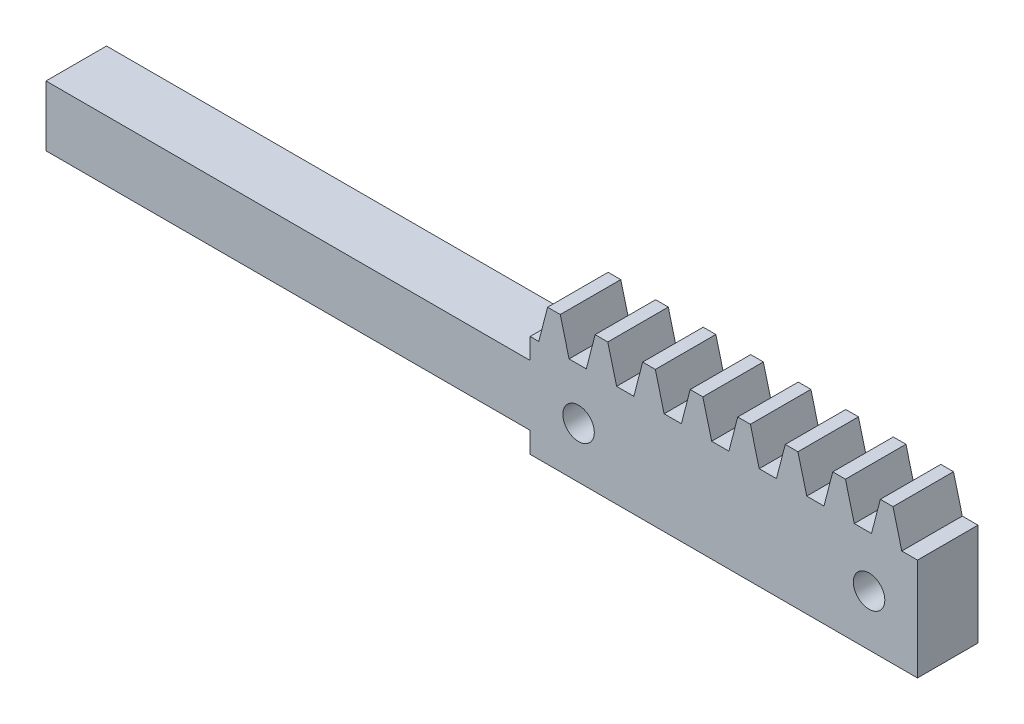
ISO-10303-21;
HEADER;
FILE_DESCRIPTION(('STEP AP214'),'2;1');
FILE_NAME('part.step','',(''),(''),'','','');
FILE_SCHEMA(('AUTOMOTIVE_DESIGN { 1 0 10303 214 1 1 1 1 }'));
ENDSEC;
DATA;
#1=APPLICATION_CONTEXT('core data for automotive mechanical design processes');
#2=APPLICATION_PROTOCOL_DEFINITION('international standard','automotive_design',2000,#1);
#3=PRODUCT_CONTEXT('',#1,'mechanical');
#4=PRODUCT('Part','Part','',(#3));
#5=PRODUCT_RELATED_PRODUCT_CATEGORY('part','',(#4));
#6=PRODUCT_DEFINITION_FORMATION('','',#4);
#7=PRODUCT_DEFINITION_CONTEXT('part definition',#1,'design');
#8=PRODUCT_DEFINITION('design','',#6,#7);
#9=PRODUCT_DEFINITION_SHAPE('','',#8);
#10=(LENGTH_UNIT() NAMED_UNIT(*) SI_UNIT(.MILLI.,.METRE.));
#11=(NAMED_UNIT(*) PLANE_ANGLE_UNIT() SI_UNIT($,.RADIAN.));
#12=(NAMED_UNIT(*) SI_UNIT($,.STERADIAN.) SOLID_ANGLE_UNIT());
#13=UNCERTAINTY_MEASURE_WITH_UNIT(LENGTH_MEASURE(1.E-05),#10,'distance_accuracy_value','');
#14=(GEOMETRIC_REPRESENTATION_CONTEXT(3) GLOBAL_UNCERTAINTY_ASSIGNED_CONTEXT((#13)) GLOBAL_UNIT_ASSIGNED_CONTEXT((#10,
#11,#12)) REPRESENTATION_CONTEXT('',''));
#15=CARTESIAN_POINT('',(0.,0.,0.));
#16=DIRECTION('',(0.,0.,1.));
#17=DIRECTION('',(1.,0.,0.));
#18=AXIS2_PLACEMENT_3D('',#15,#16,#17);
#19=CARTESIAN_POINT('',(0.988416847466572,2.95474098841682,-4.7625));
#20=DIRECTION('',(-1.,0.,0.));
#21=DIRECTION('',(0.,0.,1.));
#22=AXIS2_PLACEMENT_3D('',#19,#20,#21);
#23=PLANE('',#22);
#24=DIRECTION('',(0.,-1.,0.));
#25=VECTOR('',#24,1.);
#26=CARTESIAN_POINT('',(0.988416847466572,2.95474098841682,-4.7625));
#27=LINE('',#26,#25);
#28=CARTESIAN_POINT('',(0.988416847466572,8.31255348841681,-4.7625));
#29=VERTEX_POINT('',#28);
#30=CARTESIAN_POINT('',(0.988416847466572,7.22114723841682,-4.7625));
#31=VERTEX_POINT('',#30);
#32=EDGE_CURVE('E309',#29,#31,#27,.T.);
#33=ORIENTED_EDGE('',*,*,#32,.T.);
#34=DIRECTION('',(0.,0.,1.));
#35=VECTOR('',#34,1.);
#36=CARTESIAN_POINT('',(0.988416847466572,7.22114723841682,-4.7625));
#37=LINE('',#36,#35);
#38=CARTESIAN_POINT('',(0.988416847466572,7.22114723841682,-1.5875));
#39=VERTEX_POINT('',#38);
#40=EDGE_CURVE('E292',#31,#39,#37,.T.);
#41=ORIENTED_EDGE('',*,*,#40,.T.);
#42=DIRECTION('',(0.,-1.,0.));
#43=VECTOR('',#42,1.);
#44=CARTESIAN_POINT('',(0.988416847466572,2.95474098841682,-1.5875));
#45=LINE('',#44,#43);
#46=CARTESIAN_POINT('',(0.988416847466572,8.31255348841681,-1.5875));
#47=VERTEX_POINT('',#46);
#48=EDGE_CURVE('E349',#47,#39,#45,.T.);
#49=ORIENTED_EDGE('',*,*,#48,.F.);
#50=DIRECTION('',(0.,0.,1.));
#51=VECTOR('',#50,1.);
#52=CARTESIAN_POINT('',(0.988416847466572,8.31255348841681,-4.7625));
#53=LINE('',#52,#51);
#54=EDGE_CURVE('E316',#29,#47,#53,.T.);
#55=ORIENTED_EDGE('',*,*,#54,.F.);
#56=EDGE_LOOP('',(#33,#41,#49,#55));
#57=FACE_BOUND('',#56,.T.);
#58=ADVANCED_FACE('F35',(#57),#23,.T.);
#59=CARTESIAN_POINT('',(0.988416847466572,10.0984909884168,-4.7625));
#60=DIRECTION('',(0.,1.,0.));
#61=DIRECTION('',(0.,0.,1.));
#62=AXIS2_PLACEMENT_3D('',#59,#60,#61);
#63=PLANE('',#62);
#64=DIRECTION('',(0.,0.,1.));
#65=VECTOR('',#64,1.);
#66=CARTESIAN_POINT('',(17.5294785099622,10.0984909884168,-4.7625));
#67=LINE('',#66,#65);
#68=CARTESIAN_POINT('',(17.5294785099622,10.0984909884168,-4.7625));
#69=VERTEX_POINT('',#68);
#70=CARTESIAN_POINT('',(17.5294785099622,10.0984909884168,-1.5875));
#71=VERTEX_POINT('',#70);
#72=EDGE_CURVE('E511',#69,#71,#67,.T.);
#73=ORIENTED_EDGE('',*,*,#72,.F.);
#74=DIRECTION('',(-1.,0.,0.));
#75=VECTOR('',#74,1.);
#76=CARTESIAN_POINT('',(0.988416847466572,10.0984909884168,-4.7625));
#77=LINE('',#76,#75);
#78=CARTESIAN_POINT('',(16.8646643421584,10.0984909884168,-4.7625));
#79=VERTEX_POINT('',#78);
#80=EDGE_CURVE('E340',#69,#79,#77,.T.);
#81=ORIENTED_EDGE('',*,*,#80,.T.);
#82=DIRECTION('',(0.,0.,-1.));
#83=VECTOR('',#82,1.);
#84=CARTESIAN_POINT('',(16.8646643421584,10.0984909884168,-4.7625));
#85=LINE('',#84,#83);
#86=CARTESIAN_POINT('',(16.8646643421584,10.0984909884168,-1.5875));
#87=VERTEX_POINT('',#86);
#88=EDGE_CURVE('E496',#87,#79,#85,.T.);
#89=ORIENTED_EDGE('',*,*,#88,.F.);
#90=DIRECTION('',(-1.,0.,0.));
#91=VECTOR('',#90,1.);
#92=CARTESIAN_POINT('',(0.988416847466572,10.0984909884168,-1.5875));
#93=LINE('',#92,#91);
#94=EDGE_CURVE('E664',#71,#87,#93,.T.);
#95=ORIENTED_EDGE('',*,*,#94,.F.);
#96=EDGE_LOOP('',(#73,#81,#89,#95));
#97=FACE_BOUND('',#96,.T.);
#98=ADVANCED_FACE('F608',(#97),#63,.T.);
#99=DIRECTION('',(0.,0.,1.));
#100=VECTOR('',#99,1.);
#101=CARTESIAN_POINT('',(15.0358393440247,10.0984909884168,-4.7625));
#102=LINE('',#101,#100);
#103=CARTESIAN_POINT('',(15.0358393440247,10.0984909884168,-4.7625));
#104=VERTEX_POINT('',#103);
#105=CARTESIAN_POINT('',(15.0358393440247,10.0984909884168,-1.5875));
#106=VERTEX_POINT('',#105);
#107=EDGE_CURVE('E487',#104,#106,#102,.T.);
#108=ORIENTED_EDGE('',*,*,#107,.F.);
#109=CARTESIAN_POINT('',(14.3710251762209,10.0984909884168,-4.7625));
#110=VERTEX_POINT('',#109);
#111=EDGE_CURVE('E698',#104,#110,#77,.T.);
#112=ORIENTED_EDGE('',*,*,#111,.T.);
#113=DIRECTION('',(0.,0.,-1.));
#114=VECTOR('',#113,1.);
#115=CARTESIAN_POINT('',(14.3710251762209,10.0984909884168,-4.7625));
#116=LINE('',#115,#114);
#117=CARTESIAN_POINT('',(14.3710251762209,10.0984909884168,-1.5875));
#118=VERTEX_POINT('',#117);
#119=EDGE_CURVE('E472',#118,#110,#116,.T.);
#120=ORIENTED_EDGE('',*,*,#119,.F.);
#121=EDGE_CURVE('E670',#106,#118,#93,.T.);
#122=ORIENTED_EDGE('',*,*,#121,.F.);
#123=EDGE_LOOP('',(#108,#112,#120,#122));
#124=FACE_BOUND('',#123,.T.);
#125=ADVANCED_FACE('F612',(#124),#63,.T.);
#126=DIRECTION('',(0.,0.,1.));
#127=VECTOR('',#126,1.);
#128=CARTESIAN_POINT('',(12.5422001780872,10.0984909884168,-4.7625));
#129=LINE('',#128,#127);
#130=CARTESIAN_POINT('',(12.5422001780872,10.0984909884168,-4.7625));
#131=VERTEX_POINT('',#130);
#132=CARTESIAN_POINT('',(12.5422001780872,10.0984909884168,-1.5875));
#133=VERTEX_POINT('',#132);
#134=EDGE_CURVE('E463',#131,#133,#129,.T.);
#135=ORIENTED_EDGE('',*,*,#134,.F.);
#136=CARTESIAN_POINT('',(11.8773860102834,10.0984909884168,-4.7625));
#137=VERTEX_POINT('',#136);
#138=EDGE_CURVE('E697',#131,#137,#77,.T.);
#139=ORIENTED_EDGE('',*,*,#138,.T.);
#140=DIRECTION('',(0.,0.,-1.));
#141=VECTOR('',#140,1.);
#142=CARTESIAN_POINT('',(11.8773860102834,10.0984909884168,-4.7625));
#143=LINE('',#142,#141);
#144=CARTESIAN_POINT('',(11.8773860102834,10.0984909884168,-1.5875));
#145=VERTEX_POINT('',#144);
#146=EDGE_CURVE('E448',#145,#137,#143,.T.);
#147=ORIENTED_EDGE('',*,*,#146,.F.);
#148=EDGE_CURVE('E672',#133,#145,#93,.T.);
#149=ORIENTED_EDGE('',*,*,#148,.F.);
#150=EDGE_LOOP('',(#135,#139,#147,#149));
#151=FACE_BOUND('',#150,.T.);
#152=ADVANCED_FACE('F695',(#151),#63,.T.);
#153=DIRECTION('',(0.,0.,1.));
#154=VECTOR('',#153,1.);
#155=CARTESIAN_POINT('',(10.0485610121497,10.0984909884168,-4.7625));
#156=LINE('',#155,#154);
#157=CARTESIAN_POINT('',(10.0485610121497,10.0984909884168,-4.7625));
#158=VERTEX_POINT('',#157);
#159=CARTESIAN_POINT('',(10.0485610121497,10.0984909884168,-1.5875));
#160=VERTEX_POINT('',#159);
#161=EDGE_CURVE('E439',#158,#160,#156,.T.);
#162=ORIENTED_EDGE('',*,*,#161,.F.);
#163=CARTESIAN_POINT('',(9.38374684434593,10.0984909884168,-4.7625));
#164=VERTEX_POINT('',#163);
#165=EDGE_CURVE('E699',#158,#164,#77,.T.);
#166=ORIENTED_EDGE('',*,*,#165,.T.);
#167=DIRECTION('',(0.,0.,-1.));
#168=VECTOR('',#167,1.);
#169=CARTESIAN_POINT('',(9.38374684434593,10.0984909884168,-4.7625));
#170=LINE('',#169,#168);
#171=CARTESIAN_POINT('',(9.38374684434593,10.0984909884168,-1.5875));
#172=VERTEX_POINT('',#171);
#173=EDGE_CURVE('E424',#172,#164,#170,.T.);
#174=ORIENTED_EDGE('',*,*,#173,.F.);
#175=EDGE_CURVE('E679',#160,#172,#93,.T.);
#176=ORIENTED_EDGE('',*,*,#175,.F.);
#177=EDGE_LOOP('',(#162,#166,#174,#176));
#178=FACE_BOUND('',#177,.T.);
#179=ADVANCED_FACE('F1009',(#178),#63,.T.);
#180=DIRECTION('',(0.,0.,1.));
#181=VECTOR('',#180,1.);
#182=CARTESIAN_POINT('',(7.55492184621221,10.0984909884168,-4.7625));
#183=LINE('',#182,#181);
#184=CARTESIAN_POINT('',(7.55492184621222,10.0984909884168,-4.7625));
#185=VERTEX_POINT('',#184);
#186=CARTESIAN_POINT('',(7.55492184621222,10.0984909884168,-1.5875));
#187=VERTEX_POINT('',#186);
#188=EDGE_CURVE('E415',#185,#187,#183,.T.);
#189=ORIENTED_EDGE('',*,*,#188,.F.);
#190=CARTESIAN_POINT('',(6.89010767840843,10.0984909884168,-4.7625));
#191=VERTEX_POINT('',#190);
#192=EDGE_CURVE('E700',#185,#191,#77,.T.);
#193=ORIENTED_EDGE('',*,*,#192,.T.);
#194=DIRECTION('',(0.,0.,-1.));
#195=VECTOR('',#194,1.);
#196=CARTESIAN_POINT('',(6.89010767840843,10.0984909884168,-4.7625));
#197=LINE('',#196,#195);
#198=CARTESIAN_POINT('',(6.89010767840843,10.0984909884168,-1.5875));
#199=VERTEX_POINT('',#198);
#200=EDGE_CURVE('E400',#199,#191,#197,.T.);
#201=ORIENTED_EDGE('',*,*,#200,.F.);
#202=EDGE_CURVE('E676',#187,#199,#93,.T.);
#203=ORIENTED_EDGE('',*,*,#202,.F.);
#204=EDGE_LOOP('',(#189,#193,#201,#203));
#205=FACE_BOUND('',#204,.T.);
#206=ADVANCED_FACE('F1016',(#205),#63,.T.);
#207=DIRECTION('',(0.,0.,1.));
#208=VECTOR('',#207,1.);
#209=CARTESIAN_POINT('',(5.06128268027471,10.0984909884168,-4.7625));
#210=LINE('',#209,#208);
#211=CARTESIAN_POINT('',(5.06128268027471,10.0984909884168,-4.7625));
#212=VERTEX_POINT('',#211);
#213=CARTESIAN_POINT('',(5.06128268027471,10.0984909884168,-1.5875));
#214=VERTEX_POINT('',#213);
#215=EDGE_CURVE('E391',#212,#214,#210,.T.);
#216=ORIENTED_EDGE('',*,*,#215,.F.);
#217=CARTESIAN_POINT('',(4.39646851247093,10.0984909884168,-4.7625));
#218=VERTEX_POINT('',#217);
#219=EDGE_CURVE('E705',#212,#218,#77,.T.);
#220=ORIENTED_EDGE('',*,*,#219,.T.);
#221=DIRECTION('',(0.,0.,-1.));
#222=VECTOR('',#221,1.);
#223=CARTESIAN_POINT('',(4.39646851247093,10.0984909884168,-4.7625));
#224=LINE('',#223,#222);
#225=CARTESIAN_POINT('',(4.39646851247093,10.0984909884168,-1.5875));
#226=VERTEX_POINT('',#225);
#227=EDGE_CURVE('E376',#226,#218,#224,.T.);
#228=ORIENTED_EDGE('',*,*,#227,.F.);
#229=EDGE_CURVE('E673',#214,#226,#93,.T.);
#230=ORIENTED_EDGE('',*,*,#229,.F.);
#231=EDGE_LOOP('',(#216,#220,#228,#230));
#232=FACE_BOUND('',#231,.T.);
#233=ADVANCED_FACE('F624',(#232),#63,.T.);
#234=DIRECTION('',(0.,0.,1.));
#235=VECTOR('',#234,1.);
#236=CARTESIAN_POINT('',(2.56764351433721,10.0984909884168,-4.7625));
#237=LINE('',#236,#235);
#238=CARTESIAN_POINT('',(2.56764351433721,10.0984909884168,-4.7625));
#239=VERTEX_POINT('',#238);
#240=CARTESIAN_POINT('',(2.56764351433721,10.0984909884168,-1.5875));
#241=VERTEX_POINT('',#240);
#242=EDGE_CURVE('E372',#239,#241,#237,.T.);
#243=ORIENTED_EDGE('',*,*,#242,.F.);
#244=CARTESIAN_POINT('',(1.90282934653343,10.0984909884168,-4.7625));
#245=VERTEX_POINT('',#244);
#246=EDGE_CURVE('E336',#239,#245,#77,.T.);
#247=ORIENTED_EDGE('',*,*,#246,.T.);
#248=DIRECTION('',(0.,0.,-1.));
#249=VECTOR('',#248,1.);
#250=CARTESIAN_POINT('',(1.90282934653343,10.0984909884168,-4.7625));
#251=LINE('',#250,#249);
#252=CARTESIAN_POINT('',(1.90282934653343,10.0984909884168,-1.5875));
#253=VERTEX_POINT('',#252);
#254=EDGE_CURVE('E330',#253,#245,#251,.T.);
#255=ORIENTED_EDGE('',*,*,#254,.F.);
#256=EDGE_CURVE('E671',#241,#253,#93,.T.);
#257=ORIENTED_EDGE('',*,*,#256,.F.);
#258=EDGE_LOOP('',(#243,#247,#255,#257));
#259=FACE_BOUND('',#258,.T.);
#260=ADVANCED_FACE('F616',(#259),#63,.T.);
#261=DIRECTION('',(0.,0.,1.));
#262=VECTOR('',#261,1.);
#263=CARTESIAN_POINT('',(0.988416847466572,4.04614723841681,-4.7625));
#264=LINE('',#263,#262);
#265=CARTESIAN_POINT('',(0.988416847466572,4.04614723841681,-4.7625));
#266=VERTEX_POINT('',#265);
#267=CARTESIAN_POINT('',(0.988416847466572,4.04614723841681,-1.5875));
#268=VERTEX_POINT('',#267);
#269=EDGE_CURVE('E566',#266,#268,#264,.T.);
#270=ORIENTED_EDGE('',*,*,#269,.F.);
#271=CARTESIAN_POINT('',(0.988416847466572,2.95474098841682,-4.7625));
#272=VERTEX_POINT('',#271);
#273=EDGE_CURVE('E318',#266,#272,#27,.T.);
#274=ORIENTED_EDGE('',*,*,#273,.T.);
#275=DIRECTION('',(0.,0.,1.));
#276=VECTOR('',#275,1.);
#277=CARTESIAN_POINT('',(0.988416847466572,2.95474098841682,-4.7625));
#278=LINE('',#277,#276);
#279=CARTESIAN_POINT('',(0.988416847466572,2.95474098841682,-1.5875));
#280=VERTEX_POINT('',#279);
#281=EDGE_CURVE('E339',#272,#280,#278,.T.);
#282=ORIENTED_EDGE('',*,*,#281,.T.);
#283=EDGE_CURVE('E347',#268,#280,#45,.T.);
#284=ORIENTED_EDGE('',*,*,#283,.F.);
#285=EDGE_LOOP('',(#270,#274,#282,#284));
#286=FACE_BOUND('',#285,.T.);
#287=ADVANCED_FACE('F37',(#286),#23,.T.);
#288=DIRECTION('',(0.,0.,1.));
#289=VECTOR('',#288,1.);
#290=CARTESIAN_POINT('',(20.0231176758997,10.0984909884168,-4.7625));
#291=LINE('',#290,#289);
#292=CARTESIAN_POINT('',(20.0231176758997,10.0984909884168,-4.7625));
#293=VERTEX_POINT('',#292);
#294=CARTESIAN_POINT('',(20.0231176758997,10.0984909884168,-1.5875));
#295=VERTEX_POINT('',#294);
#296=EDGE_CURVE('E535',#293,#295,#291,.T.);
#297=ORIENTED_EDGE('',*,*,#296,.F.);
#298=CARTESIAN_POINT('',(19.3583035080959,10.0984909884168,-4.7625));
#299=VERTEX_POINT('',#298);
#300=EDGE_CURVE('E337',#293,#299,#77,.T.);
#301=ORIENTED_EDGE('',*,*,#300,.T.);
#302=DIRECTION('',(0.,0.,-1.));
#303=VECTOR('',#302,1.);
#304=CARTESIAN_POINT('',(19.3583035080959,10.0984909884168,-4.7625));
#305=LINE('',#304,#303);
#306=CARTESIAN_POINT('',(19.3583035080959,10.0984909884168,-1.5875));
#307=VERTEX_POINT('',#306);
#308=EDGE_CURVE('E520',#307,#299,#305,.T.);
#309=ORIENTED_EDGE('',*,*,#308,.F.);
#310=EDGE_CURVE('E323',#295,#307,#93,.T.);
#311=ORIENTED_EDGE('',*,*,#310,.F.);
#312=EDGE_LOOP('',(#297,#301,#309,#311));
#313=FACE_BOUND('',#312,.T.);
#314=ADVANCED_FACE('F614',(#313),#63,.T.);
#315=CARTESIAN_POINT('',(21.3084168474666,2.95474098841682,-4.7625));
#316=DIRECTION('',(1.,0.,0.));
#317=DIRECTION('',(0.,0.,-1.));
#318=AXIS2_PLACEMENT_3D('',#315,#316,#317);
#319=PLANE('',#318);
#320=DIRECTION('',(0.,0.,-1.));
#321=VECTOR('',#320,1.);
#322=CARTESIAN_POINT('',(21.3084168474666,8.31255348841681,-4.7625));
#323=LINE('',#322,#321);
#324=CARTESIAN_POINT('',(21.3084168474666,8.31255348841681,-1.5875));
#325=VERTEX_POINT('',#324);
#326=CARTESIAN_POINT('',(21.3084168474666,8.31255348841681,-4.7625));
#327=VERTEX_POINT('',#326);
#328=EDGE_CURVE('E544',#325,#327,#323,.T.);
#329=ORIENTED_EDGE('',*,*,#328,.F.);
#330=DIRECTION('',(0.,1.,0.));
#331=VECTOR('',#330,1.);
#332=CARTESIAN_POINT('',(21.3084168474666,2.95474098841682,-1.5875));
#333=LINE('',#332,#331);
#334=CARTESIAN_POINT('',(21.3084168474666,2.95474098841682,-1.5875));
#335=VERTEX_POINT('',#334);
#336=EDGE_CURVE('E353',#335,#325,#333,.T.);
#337=ORIENTED_EDGE('',*,*,#336,.F.);
#338=DIRECTION('',(0.,0.,1.));
#339=VECTOR('',#338,1.);
#340=CARTESIAN_POINT('',(21.3084168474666,2.95474098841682,-4.7625));
#341=LINE('',#340,#339);
#342=CARTESIAN_POINT('',(21.3084168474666,2.95474098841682,-4.7625));
#343=VERTEX_POINT('',#342);
#344=EDGE_CURVE('E634',#343,#335,#341,.T.);
#345=ORIENTED_EDGE('',*,*,#344,.F.);
#346=DIRECTION('',(0.,1.,0.));
#347=VECTOR('',#346,1.);
#348=CARTESIAN_POINT('',(21.3084168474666,2.95474098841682,-4.7625));
#349=LINE('',#348,#347);
#350=EDGE_CURVE('E321',#343,#327,#349,.T.);
#351=ORIENTED_EDGE('',*,*,#350,.T.);
#352=EDGE_LOOP('',(#329,#337,#345,#351));
#353=FACE_BOUND('',#352,.T.);
#354=ADVANCED_FACE('F622',(#353),#319,.T.);
#355=CARTESIAN_POINT('',(0.988416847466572,2.95474098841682,-4.7625));
#356=DIRECTION('',(0.,-1.,0.));
#357=DIRECTION('',(0.,0.,-1.));
#358=AXIS2_PLACEMENT_3D('',#355,#356,#357);
#359=PLANE('',#358);
#360=DIRECTION('',(1.,0.,0.));
#361=VECTOR('',#360,1.);
#362=CARTESIAN_POINT('',(0.988416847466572,2.95474098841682,-1.5875));
#363=LINE('',#362,#361);
#364=EDGE_CURVE('E343',#280,#335,#363,.T.);
#365=ORIENTED_EDGE('',*,*,#364,.F.);
#366=ORIENTED_EDGE('',*,*,#281,.F.);
#367=DIRECTION('',(1.,0.,0.));
#368=VECTOR('',#367,1.);
#369=CARTESIAN_POINT('',(0.988416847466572,2.95474098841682,-4.7625));
#370=LINE('',#369,#368);
#371=EDGE_CURVE('E317',#272,#343,#370,.T.);
#372=ORIENTED_EDGE('',*,*,#371,.T.);
#373=ORIENTED_EDGE('',*,*,#344,.T.);
#374=EDGE_LOOP('',(#365,#366,#372,#373));
#375=FACE_BOUND('',#374,.T.);
#376=ADVANCED_FACE('F601',(#375),#359,.T.);
#377=CARTESIAN_POINT('',(0.988416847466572,10.0984909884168,-4.7625));
#378=DIRECTION('',(0.,0.,-1.));
#379=DIRECTION('',(-1.,0.,0.));
#380=AXIS2_PLACEMENT_3D('',#377,#378,#379);
#381=PLANE('',#380);
#382=CARTESIAN_POINT('',(18.7684168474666,5.63364723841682,-4.7625));
#383=DIRECTION('',(0.,0.,-1.));
#384=DIRECTION('',(-1.,0.,0.));
#385=AXIS2_PLACEMENT_3D('',#382,#383,#384);
#386=CIRCLE('',#385,0.8255);
#387=CARTESIAN_POINT('',(17.9429168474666,5.63364723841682,-4.7625));
#388=VERTEX_POINT('',#387);
#389=EDGE_CURVE('E560',#388,#388,#386,.T.);
#390=ORIENTED_EDGE('',*,*,#389,.F.);
#391=EDGE_LOOP('',(#390));
#392=FACE_BOUND('',#391,.T.);
#393=CARTESIAN_POINT('',(3.52841684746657,5.63364723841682,-4.7625));
#394=DIRECTION('',(0.,0.,-1.));
#395=DIRECTION('',(-1.,0.,0.));
#396=AXIS2_PLACEMENT_3D('',#393,#394,#395);
#397=CIRCLE('',#396,0.8255);
#398=CARTESIAN_POINT('',(2.70291684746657,5.63364723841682,-4.7625));
#399=VERTEX_POINT('',#398);
#400=EDGE_CURVE('E551',#399,#399,#397,.T.);
#401=ORIENTED_EDGE('',*,*,#400,.F.);
#402=EDGE_LOOP('',(#401));
#403=FACE_BOUND('',#402,.T.);
#404=DIRECTION('',(0.250380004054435,-0.968147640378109,0.));
#405=VECTOR('',#404,1.);
#406=CARTESIAN_POINT('',(20.0198332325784,10.1111909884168,-4.7625));
#407=LINE('',#406,#405);
#408=CARTESIAN_POINT('',(20.4849925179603,8.31255348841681,-4.7625));
#409=VERTEX_POINT('',#408);
#410=EDGE_CURVE('E550',#293,#409,#407,.T.);
#411=ORIENTED_EDGE('',*,*,#410,.T.);
#412=DIRECTION('',(1.,0.,0.));
#413=VECTOR('',#412,1.);
#414=CARTESIAN_POINT('',(21.3900678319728,8.31255348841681,-4.7625));
#415=LINE('',#414,#413);
#416=EDGE_CURVE('E547',#409,#327,#415,.T.);
#417=ORIENTED_EDGE('',*,*,#416,.T.);
#418=ORIENTED_EDGE('',*,*,#350,.F.);
#419=ORIENTED_EDGE('',*,*,#371,.F.);
#420=ORIENTED_EDGE('',*,*,#273,.F.);
#421=DIRECTION('',(1.,0.,0.));
#422=VECTOR('',#421,1.);
#423=CARTESIAN_POINT('',(-24.4115831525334,4.04614723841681,-4.7625));
#424=LINE('',#423,#422);
#425=CARTESIAN_POINT('',(-24.4115831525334,4.04614723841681,-4.7625));
#426=VERTEX_POINT('',#425);
#427=EDGE_CURVE('E301',#426,#266,#424,.T.);
#428=ORIENTED_EDGE('',*,*,#427,.F.);
#429=DIRECTION('',(0.,-1.,0.));
#430=VECTOR('',#429,1.);
#431=CARTESIAN_POINT('',(-24.4115831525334,7.22114723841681,-4.7625));
#432=LINE('',#431,#430);
#433=CARTESIAN_POINT('',(-24.4115831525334,7.22114723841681,-4.7625));
#434=VERTEX_POINT('',#433);
#435=EDGE_CURVE('E312',#434,#426,#432,.T.);
#436=ORIENTED_EDGE('',*,*,#435,.F.);
#437=DIRECTION('',(-1.,0.,0.));
#438=VECTOR('',#437,1.);
#439=CARTESIAN_POINT('',(0.988416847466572,7.22114723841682,-4.7625));
#440=LINE('',#439,#438);
#441=EDGE_CURVE('E295',#31,#434,#440,.T.);
#442=ORIENTED_EDGE('',*,*,#441,.F.);
#443=ORIENTED_EDGE('',*,*,#32,.F.);
#444=DIRECTION('',(1.,0.,0.));
#445=VECTOR('',#444,1.);
#446=CARTESIAN_POINT('',(1.44095450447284,8.31255348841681,-4.7625));
#447=LINE('',#446,#445);
#448=CARTESIAN_POINT('',(1.44095450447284,8.31255348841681,-4.7625));
#449=VERTEX_POINT('',#448);
#450=EDGE_CURVE('E371',#29,#449,#447,.T.);
#451=ORIENTED_EDGE('',*,*,#450,.T.);
#452=DIRECTION('',(0.250380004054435,0.968147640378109,0.));
#453=VECTOR('',#452,1.);
#454=CARTESIAN_POINT('',(1.90611378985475,10.1111909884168,-4.7625));
#455=LINE('',#454,#453);
#456=EDGE_CURVE('E366',#449,#245,#455,.T.);
#457=ORIENTED_EDGE('',*,*,#456,.T.);
#458=ORIENTED_EDGE('',*,*,#246,.F.);
#459=DIRECTION('',(0.250380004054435,-0.968147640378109,0.));
#460=VECTOR('',#459,1.);
#461=CARTESIAN_POINT('',(2.56435907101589,10.1111909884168,-4.7625));
#462=LINE('',#461,#460);
#463=CARTESIAN_POINT('',(3.0295183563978,8.31255348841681,-4.7625));
#464=VERTEX_POINT('',#463);
#465=EDGE_CURVE('E387',#239,#464,#462,.T.);
#466=ORIENTED_EDGE('',*,*,#465,.T.);
#467=DIRECTION('',(1.,0.,0.));
#468=VECTOR('',#467,1.);
#469=CARTESIAN_POINT('',(3.93459367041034,8.31255348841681,-4.7625));
#470=LINE('',#469,#468);
#471=CARTESIAN_POINT('',(3.93459367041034,8.31255348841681,-4.7625));
#472=VERTEX_POINT('',#471);
#473=EDGE_CURVE('E394',#464,#472,#470,.T.);
#474=ORIENTED_EDGE('',*,*,#473,.T.);
#475=DIRECTION('',(0.250380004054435,0.968147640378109,0.));
#476=VECTOR('',#475,1.);
#477=CARTESIAN_POINT('',(4.39975295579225,10.1111909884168,-4.7625));
#478=LINE('',#477,#476);
#479=EDGE_CURVE('E382',#472,#218,#478,.T.);
#480=ORIENTED_EDGE('',*,*,#479,.T.);
#481=ORIENTED_EDGE('',*,*,#219,.F.);
#482=DIRECTION('',(0.250380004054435,-0.968147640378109,0.));
#483=VECTOR('',#482,1.);
#484=CARTESIAN_POINT('',(5.05799823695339,10.1111909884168,-4.7625));
#485=LINE('',#484,#483);
#486=CARTESIAN_POINT('',(5.5231575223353,8.31255348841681,-4.7625));
#487=VERTEX_POINT('',#486);
#488=EDGE_CURVE('E411',#212,#487,#485,.T.);
#489=ORIENTED_EDGE('',*,*,#488,.T.);
#490=DIRECTION('',(1.,0.,0.));
#491=VECTOR('',#490,1.);
#492=CARTESIAN_POINT('',(6.42823283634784,8.31255348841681,-4.7625));
#493=LINE('',#492,#491);
#494=CARTESIAN_POINT('',(6.42823283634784,8.31255348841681,-4.7625));
#495=VERTEX_POINT('',#494);
#496=EDGE_CURVE('E418',#487,#495,#493,.T.);
#497=ORIENTED_EDGE('',*,*,#496,.T.);
#498=DIRECTION('',(0.250380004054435,0.968147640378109,0.));
#499=VECTOR('',#498,1.);
#500=CARTESIAN_POINT('',(6.89339212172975,10.1111909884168,-4.7625));
#501=LINE('',#500,#499);
#502=EDGE_CURVE('E406',#495,#191,#501,.T.);
#503=ORIENTED_EDGE('',*,*,#502,.T.);
#504=ORIENTED_EDGE('',*,*,#192,.F.);
#505=DIRECTION('',(0.250380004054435,-0.968147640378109,0.));
#506=VECTOR('',#505,1.);
#507=CARTESIAN_POINT('',(7.5516374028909,10.1111909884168,-4.7625));
#508=LINE('',#507,#506);
#509=CARTESIAN_POINT('',(8.0167966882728,8.31255348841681,-4.7625));
#510=VERTEX_POINT('',#509);
#511=EDGE_CURVE('E435',#185,#510,#508,.T.);
#512=ORIENTED_EDGE('',*,*,#511,.T.);
#513=DIRECTION('',(1.,0.,0.));
#514=VECTOR('',#513,1.);
#515=CARTESIAN_POINT('',(8.92187200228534,8.31255348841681,-4.7625));
#516=LINE('',#515,#514);
#517=CARTESIAN_POINT('',(8.92187200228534,8.31255348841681,-4.7625));
#518=VERTEX_POINT('',#517);
#519=EDGE_CURVE('E442',#510,#518,#516,.T.);
#520=ORIENTED_EDGE('',*,*,#519,.T.);
#521=DIRECTION('',(0.250380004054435,0.968147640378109,0.));
#522=VECTOR('',#521,1.);
#523=CARTESIAN_POINT('',(9.38703128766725,10.1111909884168,-4.7625));
#524=LINE('',#523,#522);
#525=EDGE_CURVE('E430',#518,#164,#524,.T.);
#526=ORIENTED_EDGE('',*,*,#525,.T.);
#527=ORIENTED_EDGE('',*,*,#165,.F.);
#528=DIRECTION('',(0.250380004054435,-0.968147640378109,0.));
#529=VECTOR('',#528,1.);
#530=CARTESIAN_POINT('',(10.0452765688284,10.1111909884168,-4.7625));
#531=LINE('',#530,#529);
#532=CARTESIAN_POINT('',(10.5104358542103,8.31255348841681,-4.7625));
#533=VERTEX_POINT('',#532);
#534=EDGE_CURVE('E459',#158,#533,#531,.T.);
#535=ORIENTED_EDGE('',*,*,#534,.T.);
#536=DIRECTION('',(1.,0.,0.));
#537=VECTOR('',#536,1.);
#538=CARTESIAN_POINT('',(11.4155111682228,8.31255348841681,-4.7625));
#539=LINE('',#538,#537);
#540=CARTESIAN_POINT('',(11.4155111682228,8.31255348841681,-4.7625));
#541=VERTEX_POINT('',#540);
#542=EDGE_CURVE('E466',#533,#541,#539,.T.);
#543=ORIENTED_EDGE('',*,*,#542,.T.);
#544=DIRECTION('',(0.250380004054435,0.968147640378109,0.));
#545=VECTOR('',#544,1.);
#546=CARTESIAN_POINT('',(11.8806704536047,10.1111909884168,-4.7625));
#547=LINE('',#546,#545);
#548=EDGE_CURVE('E454',#541,#137,#547,.T.);
#549=ORIENTED_EDGE('',*,*,#548,.T.);
#550=ORIENTED_EDGE('',*,*,#138,.F.);
#551=DIRECTION('',(0.250380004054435,-0.968147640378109,0.));
#552=VECTOR('',#551,1.);
#553=CARTESIAN_POINT('',(12.5389157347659,10.1111909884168,-4.7625));
#554=LINE('',#553,#552);
#555=CARTESIAN_POINT('',(13.0040750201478,8.31255348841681,-4.7625));
#556=VERTEX_POINT('',#555);
#557=EDGE_CURVE('E483',#131,#556,#554,.T.);
#558=ORIENTED_EDGE('',*,*,#557,.T.);
#559=DIRECTION('',(1.,0.,0.));
#560=VECTOR('',#559,1.);
#561=CARTESIAN_POINT('',(13.9091503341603,8.31255348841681,-4.7625));
#562=LINE('',#561,#560);
#563=CARTESIAN_POINT('',(13.9091503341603,8.31255348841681,-4.7625));
#564=VERTEX_POINT('',#563);
#565=EDGE_CURVE('E490',#556,#564,#562,.T.);
#566=ORIENTED_EDGE('',*,*,#565,.T.);
#567=DIRECTION('',(0.250380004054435,0.968147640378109,0.));
#568=VECTOR('',#567,1.);
#569=CARTESIAN_POINT('',(14.3743096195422,10.1111909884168,-4.7625));
#570=LINE('',#569,#568);
#571=EDGE_CURVE('E478',#564,#110,#570,.T.);
#572=ORIENTED_EDGE('',*,*,#571,.T.);
#573=ORIENTED_EDGE('',*,*,#111,.F.);
#574=DIRECTION('',(0.250380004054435,-0.968147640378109,0.));
#575=VECTOR('',#574,1.);
#576=CARTESIAN_POINT('',(15.0325549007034,10.1111909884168,-4.7625));
#577=LINE('',#576,#575);
#578=CARTESIAN_POINT('',(15.4977141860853,8.31255348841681,-4.7625));
#579=VERTEX_POINT('',#578);
#580=EDGE_CURVE('E507',#104,#579,#577,.T.);
#581=ORIENTED_EDGE('',*,*,#580,.T.);
#582=DIRECTION('',(1.,0.,0.));
#583=VECTOR('',#582,1.);
#584=CARTESIAN_POINT('',(16.4027895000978,8.31255348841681,-4.7625));
#585=LINE('',#584,#583);
#586=CARTESIAN_POINT('',(16.4027895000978,8.31255348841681,-4.7625));
#587=VERTEX_POINT('',#586);
#588=EDGE_CURVE('E514',#579,#587,#585,.T.);
#589=ORIENTED_EDGE('',*,*,#588,.T.);
#590=DIRECTION('',(0.250380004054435,0.968147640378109,0.));
#591=VECTOR('',#590,1.);
#592=CARTESIAN_POINT('',(16.8679487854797,10.1111909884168,-4.7625));
#593=LINE('',#592,#591);
#594=EDGE_CURVE('E502',#587,#79,#593,.T.);
#595=ORIENTED_EDGE('',*,*,#594,.T.);
#596=ORIENTED_EDGE('',*,*,#80,.F.);
#597=DIRECTION('',(0.250380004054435,-0.968147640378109,0.));
#598=VECTOR('',#597,1.);
#599=CARTESIAN_POINT('',(17.5261940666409,10.1111909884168,-4.7625));
#600=LINE('',#599,#598);
#601=CARTESIAN_POINT('',(17.9913533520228,8.31255348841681,-4.7625));
#602=VERTEX_POINT('',#601);
#603=EDGE_CURVE('E531',#69,#602,#600,.T.);
#604=ORIENTED_EDGE('',*,*,#603,.T.);
#605=DIRECTION('',(1.,0.,0.));
#606=VECTOR('',#605,1.);
#607=CARTESIAN_POINT('',(18.8964286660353,8.31255348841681,-4.7625));
#608=LINE('',#607,#606);
#609=CARTESIAN_POINT('',(18.8964286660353,8.31255348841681,-4.7625));
#610=VERTEX_POINT('',#609);
#611=EDGE_CURVE('E538',#602,#610,#608,.T.);
#612=ORIENTED_EDGE('',*,*,#611,.T.);
#613=DIRECTION('',(0.250380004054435,0.968147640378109,0.));
#614=VECTOR('',#613,1.);
#615=CARTESIAN_POINT('',(19.3615879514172,10.1111909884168,-4.7625));
#616=LINE('',#615,#614);
#617=EDGE_CURVE('E526',#610,#299,#616,.T.);
#618=ORIENTED_EDGE('',*,*,#617,.T.);
#619=ORIENTED_EDGE('',*,*,#300,.F.);
#620=EDGE_LOOP('',(#411,#417,#418,#419,#420,#428,#436,#442,#443,#451,#457,#458,#466,#474,#480,
#481,#489,#497,#503,#504,#512,#520,#526,#527,#535,#543,#549,#550,#558,#566,#572,#573,#581,#589,
#595,#596,#604,#612,#618,#619));
#621=FACE_BOUND('',#620,.T.);
#622=ADVANCED_FACE('F307',(#392,#403,#621),#381,.T.);
#623=CARTESIAN_POINT('',(0.988416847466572,10.0984909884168,-1.5875));
#624=DIRECTION('',(0.,0.,-1.));
#625=DIRECTION('',(-1.,0.,0.));
#626=AXIS2_PLACEMENT_3D('',#623,#624,#625);
#627=PLANE('',#626);
#628=CARTESIAN_POINT('',(18.7684168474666,5.63364723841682,-1.5875));
#629=DIRECTION('',(0.,0.,1.));
#630=DIRECTION('',(1.,0.,0.));
#631=AXIS2_PLACEMENT_3D('',#628,#629,#630);
#632=CIRCLE('',#631,0.8255);
#633=CARTESIAN_POINT('',(19.5939168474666,5.63364723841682,-1.5875));
#634=VERTEX_POINT('',#633);
#635=EDGE_CURVE('E563',#634,#634,#632,.T.);
#636=ORIENTED_EDGE('',*,*,#635,.F.);
#637=EDGE_LOOP('',(#636));
#638=FACE_BOUND('',#637,.T.);
#639=CARTESIAN_POINT('',(3.52841684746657,5.63364723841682,-1.5875));
#640=DIRECTION('',(0.,0.,1.));
#641=DIRECTION('',(1.,0.,0.));
#642=AXIS2_PLACEMENT_3D('',#639,#640,#641);
#643=CIRCLE('',#642,0.8255);
#644=CARTESIAN_POINT('',(4.35391684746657,5.63364723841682,-1.5875));
#645=VERTEX_POINT('',#644);
#646=EDGE_CURVE('E557',#645,#645,#643,.T.);
#647=ORIENTED_EDGE('',*,*,#646,.F.);
#648=EDGE_LOOP('',(#647));
#649=FACE_BOUND('',#648,.T.);
#650=DIRECTION('',(1.,0.,0.));
#651=VECTOR('',#650,1.);
#652=CARTESIAN_POINT('',(21.3900678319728,8.31255348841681,-1.5875));
#653=LINE('',#652,#651);
#654=CARTESIAN_POINT('',(20.4849925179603,8.31255348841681,-1.5875));
#655=VERTEX_POINT('',#654);
#656=EDGE_CURVE('E548',#655,#325,#653,.T.);
#657=ORIENTED_EDGE('',*,*,#656,.F.);
#658=DIRECTION('',(-0.250380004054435,0.968147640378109,0.));
#659=VECTOR('',#658,1.);
#660=CARTESIAN_POINT('',(18.8298294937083,14.7125940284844,-1.5875));
#661=LINE('',#660,#659);
#662=EDGE_CURVE('E11',#655,#295,#661,.T.);
#663=ORIENTED_EDGE('',*,*,#662,.T.);
#664=ORIENTED_EDGE('',*,*,#310,.T.);
#665=DIRECTION('',(0.250380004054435,0.968147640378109,0.));
#666=VECTOR('',#665,1.);
#667=CARTESIAN_POINT('',(19.3615879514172,10.1111909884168,-1.5875));
#668=LINE('',#667,#666);
#669=CARTESIAN_POINT('',(18.8964286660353,8.31255348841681,-1.5875));
#670=VERTEX_POINT('',#669);
#671=EDGE_CURVE('E528',#670,#307,#668,.T.);
#672=ORIENTED_EDGE('',*,*,#671,.F.);
#673=DIRECTION('',(1.,0.,0.));
#674=VECTOR('',#673,1.);
#675=CARTESIAN_POINT('',(18.8964286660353,8.31255348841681,-1.5875));
#676=LINE('',#675,#674);
#677=CARTESIAN_POINT('',(17.9913533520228,8.31255348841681,-1.5875));
#678=VERTEX_POINT('',#677);
#679=EDGE_CURVE('E532',#678,#670,#676,.T.);
#680=ORIENTED_EDGE('',*,*,#679,.F.);
#681=DIRECTION('',(-0.250380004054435,0.968147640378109,0.));
#682=VECTOR('',#681,1.);
#683=CARTESIAN_POINT('',(16.4925169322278,14.1081238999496,-1.5875));
#684=LINE('',#683,#682);
#685=EDGE_CURVE('E44',#678,#71,#684,.T.);
#686=ORIENTED_EDGE('',*,*,#685,.T.);
#687=ORIENTED_EDGE('',*,*,#94,.T.);
#688=DIRECTION('',(0.250380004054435,0.968147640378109,0.));
#689=VECTOR('',#688,1.);
#690=CARTESIAN_POINT('',(16.8679487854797,10.1111909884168,-1.5875));
#691=LINE('',#690,#689);
#692=CARTESIAN_POINT('',(16.4027895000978,8.31255348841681,-1.5875));
#693=VERTEX_POINT('',#692);
#694=EDGE_CURVE('E504',#693,#87,#691,.T.);
#695=ORIENTED_EDGE('',*,*,#694,.F.);
#696=DIRECTION('',(1.,0.,0.));
#697=VECTOR('',#696,1.);
#698=CARTESIAN_POINT('',(16.4027895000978,8.31255348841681,-1.5875));
#699=LINE('',#698,#697);
#700=CARTESIAN_POINT('',(15.4977141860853,8.31255348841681,-1.5875));
#701=VERTEX_POINT('',#700);
#702=EDGE_CURVE('E508',#701,#693,#699,.T.);
#703=ORIENTED_EDGE('',*,*,#702,.F.);
#704=DIRECTION('',(-0.250380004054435,0.968147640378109,0.));
#705=VECTOR('',#704,1.);
#706=CARTESIAN_POINT('',(14.1552043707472,13.5036537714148,-1.5875));
#707=LINE('',#706,#705);
#708=EDGE_CURVE('E657',#701,#106,#707,.T.);
#709=ORIENTED_EDGE('',*,*,#708,.T.);
#710=ORIENTED_EDGE('',*,*,#121,.T.);
#711=DIRECTION('',(0.250380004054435,0.968147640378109,0.));
#712=VECTOR('',#711,1.);
#713=CARTESIAN_POINT('',(14.3743096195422,10.1111909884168,-1.5875));
#714=LINE('',#713,#712);
#715=CARTESIAN_POINT('',(13.9091503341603,8.31255348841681,-1.5875));
#716=VERTEX_POINT('',#715);
#717=EDGE_CURVE('E480',#716,#118,#714,.T.);
#718=ORIENTED_EDGE('',*,*,#717,.F.);
#719=DIRECTION('',(1.,0.,0.));
#720=VECTOR('',#719,1.);
#721=CARTESIAN_POINT('',(13.9091503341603,8.31255348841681,-1.5875));
#722=LINE('',#721,#720);
#723=CARTESIAN_POINT('',(13.0040750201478,8.31255348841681,-1.5875));
#724=VERTEX_POINT('',#723);
#725=EDGE_CURVE('E484',#724,#716,#722,.T.);
#726=ORIENTED_EDGE('',*,*,#725,.F.);
#727=DIRECTION('',(-0.250380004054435,0.968147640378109,0.));
#728=VECTOR('',#727,1.);
#729=CARTESIAN_POINT('',(11.8178918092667,12.8991836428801,-1.5875));
#730=LINE('',#729,#728);
#731=EDGE_CURVE('E654',#724,#133,#730,.T.);
#732=ORIENTED_EDGE('',*,*,#731,.T.);
#733=ORIENTED_EDGE('',*,*,#148,.T.);
#734=DIRECTION('',(0.250380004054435,0.968147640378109,0.));
#735=VECTOR('',#734,1.);
#736=CARTESIAN_POINT('',(11.8806704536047,10.1111909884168,-1.5875));
#737=LINE('',#736,#735);
#738=CARTESIAN_POINT('',(11.4155111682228,8.31255348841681,-1.5875));
#739=VERTEX_POINT('',#738);
#740=EDGE_CURVE('E456',#739,#145,#737,.T.);
#741=ORIENTED_EDGE('',*,*,#740,.F.);
#742=DIRECTION('',(1.,0.,0.));
#743=VECTOR('',#742,1.);
#744=CARTESIAN_POINT('',(11.4155111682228,8.31255348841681,-1.5875));
#745=LINE('',#744,#743);
#746=CARTESIAN_POINT('',(10.5104358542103,8.31255348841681,-1.5875));
#747=VERTEX_POINT('',#746);
#748=EDGE_CURVE('E460',#747,#739,#745,.T.);
#749=ORIENTED_EDGE('',*,*,#748,.F.);
#750=DIRECTION('',(-0.250380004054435,0.968147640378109,0.));
#751=VECTOR('',#750,1.);
#752=CARTESIAN_POINT('',(9.48057924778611,12.2947135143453,-1.5875));
#753=LINE('',#752,#751);
#754=EDGE_CURVE('E651',#747,#160,#753,.T.);
#755=ORIENTED_EDGE('',*,*,#754,.T.);
#756=ORIENTED_EDGE('',*,*,#175,.T.);
#757=DIRECTION('',(0.250380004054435,0.968147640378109,0.));
#758=VECTOR('',#757,1.);
#759=CARTESIAN_POINT('',(9.38703128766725,10.1111909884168,-1.5875));
#760=LINE('',#759,#758);
#761=CARTESIAN_POINT('',(8.92187200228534,8.31255348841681,-1.5875));
#762=VERTEX_POINT('',#761);
#763=EDGE_CURVE('E432',#762,#172,#760,.T.);
#764=ORIENTED_EDGE('',*,*,#763,.F.);
#765=DIRECTION('',(1.,0.,0.));
#766=VECTOR('',#765,1.);
#767=CARTESIAN_POINT('',(8.92187200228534,8.31255348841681,-1.5875));
#768=LINE('',#767,#766);
#769=CARTESIAN_POINT('',(8.0167966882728,8.31255348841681,-1.5875));
#770=VERTEX_POINT('',#769);
#771=EDGE_CURVE('E436',#770,#762,#768,.T.);
#772=ORIENTED_EDGE('',*,*,#771,.F.);
#773=DIRECTION('',(-0.250380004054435,0.968147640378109,0.));
#774=VECTOR('',#773,1.);
#775=CARTESIAN_POINT('',(7.14326668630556,11.6902433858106,-1.5875));
#776=LINE('',#775,#774);
#777=EDGE_CURVE('E648',#770,#187,#776,.T.);
#778=ORIENTED_EDGE('',*,*,#777,.T.);
#779=ORIENTED_EDGE('',*,*,#202,.T.);
#780=DIRECTION('',(0.250380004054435,0.968147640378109,0.));
#781=VECTOR('',#780,1.);
#782=CARTESIAN_POINT('',(6.89339212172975,10.1111909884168,-1.5875));
#783=LINE('',#782,#781);
#784=CARTESIAN_POINT('',(6.42823283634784,8.31255348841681,-1.5875));
#785=VERTEX_POINT('',#784);
#786=EDGE_CURVE('E408',#785,#199,#783,.T.);
#787=ORIENTED_EDGE('',*,*,#786,.F.);
#788=DIRECTION('',(1.,0.,0.));
#789=VECTOR('',#788,1.);
#790=CARTESIAN_POINT('',(6.42823283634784,8.31255348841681,-1.5875));
#791=LINE('',#790,#789);
#792=CARTESIAN_POINT('',(5.5231575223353,8.31255348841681,-1.5875));
#793=VERTEX_POINT('',#792);
#794=EDGE_CURVE('E412',#793,#785,#791,.T.);
#795=ORIENTED_EDGE('',*,*,#794,.F.);
#796=DIRECTION('',(-0.250380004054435,0.968147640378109,0.));
#797=VECTOR('',#796,1.);
#798=CARTESIAN_POINT('',(4.80595412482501,11.0857732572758,-1.5875));
#799=LINE('',#798,#797);
#800=EDGE_CURVE('E645',#793,#214,#799,.T.);
#801=ORIENTED_EDGE('',*,*,#800,.T.);
#802=ORIENTED_EDGE('',*,*,#229,.T.);
#803=DIRECTION('',(0.250380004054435,0.968147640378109,0.));
#804=VECTOR('',#803,1.);
#805=CARTESIAN_POINT('',(4.39975295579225,10.1111909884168,-1.5875));
#806=LINE('',#805,#804);
#807=CARTESIAN_POINT('',(3.93459367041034,8.31255348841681,-1.5875));
#808=VERTEX_POINT('',#807);
#809=EDGE_CURVE('E384',#808,#226,#806,.T.);
#810=ORIENTED_EDGE('',*,*,#809,.F.);
#811=DIRECTION('',(1.,0.,0.));
#812=VECTOR('',#811,1.);
#813=CARTESIAN_POINT('',(3.93459367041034,8.31255348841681,-1.5875));
#814=LINE('',#813,#812);
#815=CARTESIAN_POINT('',(3.0295183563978,8.31255348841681,-1.5875));
#816=VERTEX_POINT('',#815);
#817=EDGE_CURVE('E388',#816,#808,#814,.T.);
#818=ORIENTED_EDGE('',*,*,#817,.F.);
#819=DIRECTION('',(-0.250380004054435,0.968147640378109,0.));
#820=VECTOR('',#819,1.);
#821=CARTESIAN_POINT('',(2.46864156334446,10.481303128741,-1.5875));
#822=LINE('',#821,#820);
#823=EDGE_CURVE('E642',#816,#241,#822,.T.);
#824=ORIENTED_EDGE('',*,*,#823,.T.);
#825=ORIENTED_EDGE('',*,*,#256,.T.);
#826=DIRECTION('',(0.250380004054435,0.968147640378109,0.));
#827=VECTOR('',#826,1.);
#828=CARTESIAN_POINT('',(1.90611378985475,10.1111909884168,-1.5875));
#829=LINE('',#828,#827);
#830=CARTESIAN_POINT('',(1.44095450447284,8.31255348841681,-1.5875));
#831=VERTEX_POINT('',#830);
#832=EDGE_CURVE('E369',#831,#253,#829,.T.);
#833=ORIENTED_EDGE('',*,*,#832,.F.);
#834=DIRECTION('',(-1.,0.,0.));
#835=VECTOR('',#834,1.);
#836=CARTESIAN_POINT('',(0.988416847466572,8.31255348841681,-1.5875));
#837=LINE('',#836,#835);
#838=EDGE_CURVE('E637',#831,#47,#837,.T.);
#839=ORIENTED_EDGE('',*,*,#838,.T.);
#840=ORIENTED_EDGE('',*,*,#48,.T.);
#841=DIRECTION('',(-1.,0.,0.));
#842=VECTOR('',#841,1.);
#843=CARTESIAN_POINT('',(0.988416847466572,7.22114723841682,-1.5875));
#844=LINE('',#843,#842);
#845=CARTESIAN_POINT('',(-24.4115831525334,7.22114723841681,-1.5875));
#846=VERTEX_POINT('',#845);
#847=EDGE_CURVE('E52',#39,#846,#844,.T.);
#848=ORIENTED_EDGE('',*,*,#847,.T.);
#849=DIRECTION('',(0.,-1.,0.));
#850=VECTOR('',#849,1.);
#851=CARTESIAN_POINT('',(-24.4115831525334,7.22114723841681,-1.5875));
#852=LINE('',#851,#850);
#853=CARTESIAN_POINT('',(-24.4115831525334,4.04614723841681,-1.5875));
#854=VERTEX_POINT('',#853);
#855=EDGE_CURVE('E581',#846,#854,#852,.T.);
#856=ORIENTED_EDGE('',*,*,#855,.T.);
#857=DIRECTION('',(1.,0.,0.));
#858=VECTOR('',#857,1.);
#859=CARTESIAN_POINT('',(-24.4115831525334,4.04614723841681,-1.5875));
#860=LINE('',#859,#858);
#861=EDGE_CURVE('E313',#854,#268,#860,.T.);
#862=ORIENTED_EDGE('',*,*,#861,.T.);
#863=ORIENTED_EDGE('',*,*,#283,.T.);
#864=ORIENTED_EDGE('',*,*,#364,.T.);
#865=ORIENTED_EDGE('',*,*,#336,.T.);
#866=EDGE_LOOP('',(#657,#663,#664,#672,#680,#686,#687,#695,#703,#709,#710,#718,#726,#732,#733,
#741,#749,#755,#756,#764,#772,#778,#779,#787,#795,#801,#802,#810,#818,#824,#825,#833,#839,#840,
#848,#856,#862,#863,#864,#865));
#867=FACE_BOUND('',#866,.T.);
#868=ADVANCED_FACE('F589',(#638,#649,#867),#627,.F.);
#869=CARTESIAN_POINT('',(1.90611378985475,10.1111909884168,-4.7625));
#870=DIRECTION('',(0.968147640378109,-0.250380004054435,0.));
#871=DIRECTION('',(0.250380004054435,0.968147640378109,0.));
#872=AXIS2_PLACEMENT_3D('',#869,#870,#871);
#873=PLANE('',#872);
#874=ORIENTED_EDGE('',*,*,#254,.T.);
#875=ORIENTED_EDGE('',*,*,#456,.F.);
#876=DIRECTION('',(0.,0.,1.));
#877=VECTOR('',#876,1.);
#878=CARTESIAN_POINT('',(1.44095450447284,8.31255348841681,-4.7625));
#879=LINE('',#878,#877);
#880=EDGE_CURVE('E363',#449,#831,#879,.T.);
#881=ORIENTED_EDGE('',*,*,#880,.T.);
#882=ORIENTED_EDGE('',*,*,#832,.T.);
#883=EDGE_LOOP('',(#874,#875,#881,#882));
#884=FACE_BOUND('',#883,.T.);
#885=ADVANCED_FACE('F592',(#884),#873,.F.);
#886=CARTESIAN_POINT('',(1.44095450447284,8.31255348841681,-4.7625));
#887=DIRECTION('',(0.,-1.,0.));
#888=DIRECTION('',(0.,0.,-1.));
#889=AXIS2_PLACEMENT_3D('',#886,#887,#888);
#890=PLANE('',#889);
#891=ORIENTED_EDGE('',*,*,#54,.T.);
#892=ORIENTED_EDGE('',*,*,#838,.F.);
#893=ORIENTED_EDGE('',*,*,#880,.F.);
#894=ORIENTED_EDGE('',*,*,#450,.F.);
#895=EDGE_LOOP('',(#891,#892,#893,#894));
#896=FACE_BOUND('',#895,.T.);
#897=ADVANCED_FACE('F599',(#896),#890,.F.);
#898=CARTESIAN_POINT('',(2.56435907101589,10.1111909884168,-4.7625));
#899=DIRECTION('',(-0.968147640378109,-0.250380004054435,0.));
#900=DIRECTION('',(0.250380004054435,-0.968147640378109,0.));
#901=AXIS2_PLACEMENT_3D('',#898,#899,#900);
#902=PLANE('',#901);
#903=ORIENTED_EDGE('',*,*,#242,.T.);
#904=ORIENTED_EDGE('',*,*,#823,.F.);
#905=DIRECTION('',(0.,0.,1.));
#906=VECTOR('',#905,1.);
#907=CARTESIAN_POINT('',(3.0295183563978,8.31255348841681,-4.7625));
#908=LINE('',#907,#906);
#909=EDGE_CURVE('E380',#464,#816,#908,.T.);
#910=ORIENTED_EDGE('',*,*,#909,.F.);
#911=ORIENTED_EDGE('',*,*,#465,.F.);
#912=EDGE_LOOP('',(#903,#904,#910,#911));
#913=FACE_BOUND('',#912,.T.);
#914=ADVANCED_FACE('F717',(#913),#902,.F.);
#915=CARTESIAN_POINT('',(4.39975295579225,10.1111909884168,-4.7625));
#916=DIRECTION('',(0.968147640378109,-0.250380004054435,0.));
#917=DIRECTION('',(0.250380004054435,0.968147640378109,0.));
#918=AXIS2_PLACEMENT_3D('',#915,#916,#917);
#919=PLANE('',#918);
#920=ORIENTED_EDGE('',*,*,#227,.T.);
#921=ORIENTED_EDGE('',*,*,#479,.F.);
#922=DIRECTION('',(0.,0.,1.));
#923=VECTOR('',#922,1.);
#924=CARTESIAN_POINT('',(3.93459367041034,8.31255348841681,-4.7625));
#925=LINE('',#924,#923);
#926=EDGE_CURVE('E379',#472,#808,#925,.T.);
#927=ORIENTED_EDGE('',*,*,#926,.T.);
#928=ORIENTED_EDGE('',*,*,#809,.T.);
#929=EDGE_LOOP('',(#920,#921,#927,#928));
#930=FACE_BOUND('',#929,.T.);
#931=ADVANCED_FACE('F722',(#930),#919,.F.);
#932=CARTESIAN_POINT('',(3.93459367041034,8.31255348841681,-4.7625));
#933=DIRECTION('',(0.,-1.,0.));
#934=DIRECTION('',(0.,0.,-1.));
#935=AXIS2_PLACEMENT_3D('',#932,#933,#934);
#936=PLANE('',#935);
#937=ORIENTED_EDGE('',*,*,#817,.T.);
#938=ORIENTED_EDGE('',*,*,#926,.F.);
#939=ORIENTED_EDGE('',*,*,#473,.F.);
#940=ORIENTED_EDGE('',*,*,#909,.T.);
#941=EDGE_LOOP('',(#937,#938,#939,#940));
#942=FACE_BOUND('',#941,.T.);
#943=ADVANCED_FACE('F726',(#942),#936,.F.);
#944=CARTESIAN_POINT('',(5.05799823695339,10.1111909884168,-4.7625));
#945=DIRECTION('',(-0.968147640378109,-0.250380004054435,0.));
#946=DIRECTION('',(0.250380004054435,-0.968147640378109,0.));
#947=AXIS2_PLACEMENT_3D('',#944,#945,#946);
#948=PLANE('',#947);
#949=ORIENTED_EDGE('',*,*,#215,.T.);
#950=ORIENTED_EDGE('',*,*,#800,.F.);
#951=DIRECTION('',(0.,0.,1.));
#952=VECTOR('',#951,1.);
#953=CARTESIAN_POINT('',(5.5231575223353,8.31255348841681,-4.7625));
#954=LINE('',#953,#952);
#955=EDGE_CURVE('E404',#487,#793,#954,.T.);
#956=ORIENTED_EDGE('',*,*,#955,.F.);
#957=ORIENTED_EDGE('',*,*,#488,.F.);
#958=EDGE_LOOP('',(#949,#950,#956,#957));
#959=FACE_BOUND('',#958,.T.);
#960=ADVANCED_FACE('F729',(#959),#948,.F.);
#961=CARTESIAN_POINT('',(6.89339212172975,10.1111909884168,-4.7625));
#962=DIRECTION('',(0.968147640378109,-0.250380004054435,0.));
#963=DIRECTION('',(0.250380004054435,0.968147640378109,0.));
#964=AXIS2_PLACEMENT_3D('',#961,#962,#963);
#965=PLANE('',#964);
#966=ORIENTED_EDGE('',*,*,#200,.T.);
#967=ORIENTED_EDGE('',*,*,#502,.F.);
#968=DIRECTION('',(0.,0.,1.));
#969=VECTOR('',#968,1.);
#970=CARTESIAN_POINT('',(6.42823283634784,8.31255348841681,-4.7625));
#971=LINE('',#970,#969);
#972=EDGE_CURVE('E403',#495,#785,#971,.T.);
#973=ORIENTED_EDGE('',*,*,#972,.T.);
#974=ORIENTED_EDGE('',*,*,#786,.T.);
#975=EDGE_LOOP('',(#966,#967,#973,#974));
#976=FACE_BOUND('',#975,.T.);
#977=ADVANCED_FACE('F736',(#976),#965,.F.);
#978=CARTESIAN_POINT('',(6.42823283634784,8.31255348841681,-4.7625));
#979=DIRECTION('',(0.,-1.,0.));
#980=DIRECTION('',(0.,0.,-1.));
#981=AXIS2_PLACEMENT_3D('',#978,#979,#980);
#982=PLANE('',#981);
#983=ORIENTED_EDGE('',*,*,#794,.T.);
#984=ORIENTED_EDGE('',*,*,#972,.F.);
#985=ORIENTED_EDGE('',*,*,#496,.F.);
#986=ORIENTED_EDGE('',*,*,#955,.T.);
#987=EDGE_LOOP('',(#983,#984,#985,#986));
#988=FACE_BOUND('',#987,.T.);
#989=ADVANCED_FACE('F738',(#988),#982,.F.);
#990=CARTESIAN_POINT('',(7.5516374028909,10.1111909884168,-4.7625));
#991=DIRECTION('',(-0.968147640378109,-0.250380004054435,0.));
#992=DIRECTION('',(0.250380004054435,-0.968147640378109,0.));
#993=AXIS2_PLACEMENT_3D('',#990,#991,#992);
#994=PLANE('',#993);
#995=ORIENTED_EDGE('',*,*,#188,.T.);
#996=ORIENTED_EDGE('',*,*,#777,.F.);
#997=DIRECTION('',(0.,0.,1.));
#998=VECTOR('',#997,1.);
#999=CARTESIAN_POINT('',(8.0167966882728,8.31255348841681,-4.7625));
#1000=LINE('',#999,#998);
#1001=EDGE_CURVE('E428',#510,#770,#1000,.T.);
#1002=ORIENTED_EDGE('',*,*,#1001,.F.);
#1003=ORIENTED_EDGE('',*,*,#511,.F.);
#1004=EDGE_LOOP('',(#995,#996,#1002,#1003));
#1005=FACE_BOUND('',#1004,.T.);
#1006=ADVANCED_FACE('F741',(#1005),#994,.F.);
#1007=CARTESIAN_POINT('',(9.38703128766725,10.1111909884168,-4.7625));
#1008=DIRECTION('',(0.968147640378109,-0.250380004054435,0.));
#1009=DIRECTION('',(0.250380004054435,0.968147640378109,0.));
#1010=AXIS2_PLACEMENT_3D('',#1007,#1008,#1009);
#1011=PLANE('',#1010);
#1012=ORIENTED_EDGE('',*,*,#173,.T.);
#1013=ORIENTED_EDGE('',*,*,#525,.F.);
#1014=DIRECTION('',(0.,0.,1.));
#1015=VECTOR('',#1014,1.);
#1016=CARTESIAN_POINT('',(8.92187200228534,8.31255348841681,-4.7625));
#1017=LINE('',#1016,#1015);
#1018=EDGE_CURVE('E427',#518,#762,#1017,.T.);
#1019=ORIENTED_EDGE('',*,*,#1018,.T.);
#1020=ORIENTED_EDGE('',*,*,#763,.T.);
#1021=EDGE_LOOP('',(#1012,#1013,#1019,#1020));
#1022=FACE_BOUND('',#1021,.T.);
#1023=ADVANCED_FACE('F748',(#1022),#1011,.F.);
#1024=CARTESIAN_POINT('',(8.92187200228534,8.31255348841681,-4.7625));
#1025=DIRECTION('',(0.,-1.,0.));
#1026=DIRECTION('',(0.,0.,-1.));
#1027=AXIS2_PLACEMENT_3D('',#1024,#1025,#1026);
#1028=PLANE('',#1027);
#1029=ORIENTED_EDGE('',*,*,#771,.T.);
#1030=ORIENTED_EDGE('',*,*,#1018,.F.);
#1031=ORIENTED_EDGE('',*,*,#519,.F.);
#1032=ORIENTED_EDGE('',*,*,#1001,.T.);
#1033=EDGE_LOOP('',(#1029,#1030,#1031,#1032));
#1034=FACE_BOUND('',#1033,.T.);
#1035=ADVANCED_FACE('F750',(#1034),#1028,.F.);
#1036=CARTESIAN_POINT('',(10.0452765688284,10.1111909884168,-4.7625));
#1037=DIRECTION('',(-0.968147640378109,-0.250380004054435,0.));
#1038=DIRECTION('',(0.250380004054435,-0.968147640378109,0.));
#1039=AXIS2_PLACEMENT_3D('',#1036,#1037,#1038);
#1040=PLANE('',#1039);
#1041=ORIENTED_EDGE('',*,*,#161,.T.);
#1042=ORIENTED_EDGE('',*,*,#754,.F.);
#1043=DIRECTION('',(0.,0.,1.));
#1044=VECTOR('',#1043,1.);
#1045=CARTESIAN_POINT('',(10.5104358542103,8.31255348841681,-4.7625));
#1046=LINE('',#1045,#1044);
#1047=EDGE_CURVE('E452',#533,#747,#1046,.T.);
#1048=ORIENTED_EDGE('',*,*,#1047,.F.);
#1049=ORIENTED_EDGE('',*,*,#534,.F.);
#1050=EDGE_LOOP('',(#1041,#1042,#1048,#1049));
#1051=FACE_BOUND('',#1050,.T.);
#1052=ADVANCED_FACE('F753',(#1051),#1040,.F.);
#1053=CARTESIAN_POINT('',(11.8806704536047,10.1111909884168,-4.7625));
#1054=DIRECTION('',(0.968147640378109,-0.250380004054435,0.));
#1055=DIRECTION('',(0.250380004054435,0.968147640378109,0.));
#1056=AXIS2_PLACEMENT_3D('',#1053,#1054,#1055);
#1057=PLANE('',#1056);
#1058=ORIENTED_EDGE('',*,*,#146,.T.);
#1059=ORIENTED_EDGE('',*,*,#548,.F.);
#1060=DIRECTION('',(0.,0.,1.));
#1061=VECTOR('',#1060,1.);
#1062=CARTESIAN_POINT('',(11.4155111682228,8.31255348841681,-4.7625));
#1063=LINE('',#1062,#1061);
#1064=EDGE_CURVE('E451',#541,#739,#1063,.T.);
#1065=ORIENTED_EDGE('',*,*,#1064,.T.);
#1066=ORIENTED_EDGE('',*,*,#740,.T.);
#1067=EDGE_LOOP('',(#1058,#1059,#1065,#1066));
#1068=FACE_BOUND('',#1067,.T.);
#1069=ADVANCED_FACE('F693',(#1068),#1057,.F.);
#1070=CARTESIAN_POINT('',(11.4155111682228,8.31255348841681,-4.7625));
#1071=DIRECTION('',(0.,-1.,0.));
#1072=DIRECTION('',(0.,0.,-1.));
#1073=AXIS2_PLACEMENT_3D('',#1070,#1071,#1072);
#1074=PLANE('',#1073);
#1075=ORIENTED_EDGE('',*,*,#748,.T.);
#1076=ORIENTED_EDGE('',*,*,#1064,.F.);
#1077=ORIENTED_EDGE('',*,*,#542,.F.);
#1078=ORIENTED_EDGE('',*,*,#1047,.T.);
#1079=EDGE_LOOP('',(#1075,#1076,#1077,#1078));
#1080=FACE_BOUND('',#1079,.T.);
#1081=ADVANCED_FACE('F761',(#1080),#1074,.F.);
#1082=CARTESIAN_POINT('',(12.5389157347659,10.1111909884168,-4.7625));
#1083=DIRECTION('',(-0.968147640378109,-0.250380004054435,0.));
#1084=DIRECTION('',(0.250380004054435,-0.968147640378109,0.));
#1085=AXIS2_PLACEMENT_3D('',#1082,#1083,#1084);
#1086=PLANE('',#1085);
#1087=ORIENTED_EDGE('',*,*,#134,.T.);
#1088=ORIENTED_EDGE('',*,*,#731,.F.);
#1089=DIRECTION('',(0.,0.,1.));
#1090=VECTOR('',#1089,1.);
#1091=CARTESIAN_POINT('',(13.0040750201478,8.31255348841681,-4.7625));
#1092=LINE('',#1091,#1090);
#1093=EDGE_CURVE('E476',#556,#724,#1092,.T.);
#1094=ORIENTED_EDGE('',*,*,#1093,.F.);
#1095=ORIENTED_EDGE('',*,*,#557,.F.);
#1096=EDGE_LOOP('',(#1087,#1088,#1094,#1095));
#1097=FACE_BOUND('',#1096,.T.);
#1098=ADVANCED_FACE('F764',(#1097),#1086,.F.);
#1099=CARTESIAN_POINT('',(14.3743096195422,10.1111909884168,-4.7625));
#1100=DIRECTION('',(0.968147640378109,-0.250380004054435,0.));
#1101=DIRECTION('',(0.250380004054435,0.968147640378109,0.));
#1102=AXIS2_PLACEMENT_3D('',#1099,#1100,#1101);
#1103=PLANE('',#1102);
#1104=ORIENTED_EDGE('',*,*,#119,.T.);
#1105=ORIENTED_EDGE('',*,*,#571,.F.);
#1106=DIRECTION('',(0.,0.,1.));
#1107=VECTOR('',#1106,1.);
#1108=CARTESIAN_POINT('',(13.9091503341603,8.31255348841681,-4.7625));
#1109=LINE('',#1108,#1107);
#1110=EDGE_CURVE('E475',#564,#716,#1109,.T.);
#1111=ORIENTED_EDGE('',*,*,#1110,.T.);
#1112=ORIENTED_EDGE('',*,*,#717,.T.);
#1113=EDGE_LOOP('',(#1104,#1105,#1111,#1112));
#1114=FACE_BOUND('',#1113,.T.);
#1115=ADVANCED_FACE('F770',(#1114),#1103,.F.);
#1116=CARTESIAN_POINT('',(13.9091503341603,8.31255348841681,-4.7625));
#1117=DIRECTION('',(0.,-1.,0.));
#1118=DIRECTION('',(0.,0.,-1.));
#1119=AXIS2_PLACEMENT_3D('',#1116,#1117,#1118);
#1120=PLANE('',#1119);
#1121=ORIENTED_EDGE('',*,*,#725,.T.);
#1122=ORIENTED_EDGE('',*,*,#1110,.F.);
#1123=ORIENTED_EDGE('',*,*,#565,.F.);
#1124=ORIENTED_EDGE('',*,*,#1093,.T.);
#1125=EDGE_LOOP('',(#1121,#1122,#1123,#1124));
#1126=FACE_BOUND('',#1125,.T.);
#1127=ADVANCED_FACE('F772',(#1126),#1120,.F.);
#1128=CARTESIAN_POINT('',(15.0325549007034,10.1111909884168,-4.7625));
#1129=DIRECTION('',(-0.968147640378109,-0.250380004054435,0.));
#1130=DIRECTION('',(0.250380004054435,-0.968147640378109,0.));
#1131=AXIS2_PLACEMENT_3D('',#1128,#1129,#1130);
#1132=PLANE('',#1131);
#1133=ORIENTED_EDGE('',*,*,#107,.T.);
#1134=ORIENTED_EDGE('',*,*,#708,.F.);
#1135=DIRECTION('',(0.,0.,1.));
#1136=VECTOR('',#1135,1.);
#1137=CARTESIAN_POINT('',(15.4977141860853,8.31255348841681,-4.7625));
#1138=LINE('',#1137,#1136);
#1139=EDGE_CURVE('E500',#579,#701,#1138,.T.);
#1140=ORIENTED_EDGE('',*,*,#1139,.F.);
#1141=ORIENTED_EDGE('',*,*,#580,.F.);
#1142=EDGE_LOOP('',(#1133,#1134,#1140,#1141));
#1143=FACE_BOUND('',#1142,.T.);
#1144=ADVANCED_FACE('F775',(#1143),#1132,.F.);
#1145=CARTESIAN_POINT('',(16.8679487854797,10.1111909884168,-4.7625));
#1146=DIRECTION('',(0.968147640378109,-0.250380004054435,0.));
#1147=DIRECTION('',(0.250380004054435,0.968147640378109,0.));
#1148=AXIS2_PLACEMENT_3D('',#1145,#1146,#1147);
#1149=PLANE('',#1148);
#1150=ORIENTED_EDGE('',*,*,#88,.T.);
#1151=ORIENTED_EDGE('',*,*,#594,.F.);
#1152=DIRECTION('',(0.,0.,1.));
#1153=VECTOR('',#1152,1.);
#1154=CARTESIAN_POINT('',(16.4027895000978,8.31255348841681,-4.7625));
#1155=LINE('',#1154,#1153);
#1156=EDGE_CURVE('E499',#587,#693,#1155,.T.);
#1157=ORIENTED_EDGE('',*,*,#1156,.T.);
#1158=ORIENTED_EDGE('',*,*,#694,.T.);
#1159=EDGE_LOOP('',(#1150,#1151,#1157,#1158));
#1160=FACE_BOUND('',#1159,.T.);
#1161=ADVANCED_FACE('F782',(#1160),#1149,.F.);
#1162=CARTESIAN_POINT('',(16.4027895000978,8.31255348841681,-4.7625));
#1163=DIRECTION('',(0.,-1.,0.));
#1164=DIRECTION('',(0.,0.,-1.));
#1165=AXIS2_PLACEMENT_3D('',#1162,#1163,#1164);
#1166=PLANE('',#1165);
#1167=ORIENTED_EDGE('',*,*,#702,.T.);
#1168=ORIENTED_EDGE('',*,*,#1156,.F.);
#1169=ORIENTED_EDGE('',*,*,#588,.F.);
#1170=ORIENTED_EDGE('',*,*,#1139,.T.);
#1171=EDGE_LOOP('',(#1167,#1168,#1169,#1170));
#1172=FACE_BOUND('',#1171,.T.);
#1173=ADVANCED_FACE('F784',(#1172),#1166,.F.);
#1174=CARTESIAN_POINT('',(17.5261940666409,10.1111909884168,-4.7625));
#1175=DIRECTION('',(-0.968147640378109,-0.250380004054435,0.));
#1176=DIRECTION('',(0.250380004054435,-0.968147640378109,0.));
#1177=AXIS2_PLACEMENT_3D('',#1174,#1175,#1176);
#1178=PLANE('',#1177);
#1179=ORIENTED_EDGE('',*,*,#72,.T.);
#1180=ORIENTED_EDGE('',*,*,#685,.F.);
#1181=DIRECTION('',(0.,0.,1.));
#1182=VECTOR('',#1181,1.);
#1183=CARTESIAN_POINT('',(17.9913533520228,8.31255348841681,-4.7625));
#1184=LINE('',#1183,#1182);
#1185=EDGE_CURVE('E524',#602,#678,#1184,.T.);
#1186=ORIENTED_EDGE('',*,*,#1185,.F.);
#1187=ORIENTED_EDGE('',*,*,#603,.F.);
#1188=EDGE_LOOP('',(#1179,#1180,#1186,#1187));
#1189=FACE_BOUND('',#1188,.T.);
#1190=ADVANCED_FACE('F787',(#1189),#1178,.F.);
#1191=CARTESIAN_POINT('',(19.3615879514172,10.1111909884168,-4.7625));
#1192=DIRECTION('',(0.968147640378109,-0.250380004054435,0.));
#1193=DIRECTION('',(0.250380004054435,0.968147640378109,0.));
#1194=AXIS2_PLACEMENT_3D('',#1191,#1192,#1193);
#1195=PLANE('',#1194);
#1196=ORIENTED_EDGE('',*,*,#308,.T.);
#1197=ORIENTED_EDGE('',*,*,#617,.F.);
#1198=DIRECTION('',(0.,0.,1.));
#1199=VECTOR('',#1198,1.);
#1200=CARTESIAN_POINT('',(18.8964286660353,8.31255348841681,-4.7625));
#1201=LINE('',#1200,#1199);
#1202=EDGE_CURVE('E523',#610,#670,#1201,.T.);
#1203=ORIENTED_EDGE('',*,*,#1202,.T.);
#1204=ORIENTED_EDGE('',*,*,#671,.T.);
#1205=EDGE_LOOP('',(#1196,#1197,#1203,#1204));
#1206=FACE_BOUND('',#1205,.T.);
#1207=ADVANCED_FACE('F794',(#1206),#1195,.F.);
#1208=CARTESIAN_POINT('',(18.8964286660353,8.31255348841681,-4.7625));
#1209=DIRECTION('',(0.,-1.,0.));
#1210=DIRECTION('',(0.,0.,-1.));
#1211=AXIS2_PLACEMENT_3D('',#1208,#1209,#1210);
#1212=PLANE('',#1211);
#1213=ORIENTED_EDGE('',*,*,#679,.T.);
#1214=ORIENTED_EDGE('',*,*,#1202,.F.);
#1215=ORIENTED_EDGE('',*,*,#611,.F.);
#1216=ORIENTED_EDGE('',*,*,#1185,.T.);
#1217=EDGE_LOOP('',(#1213,#1214,#1215,#1216));
#1218=FACE_BOUND('',#1217,.T.);
#1219=ADVANCED_FACE('F795',(#1218),#1212,.F.);
#1220=CARTESIAN_POINT('',(20.0198332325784,10.1111909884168,-4.7625));
#1221=DIRECTION('',(-0.968147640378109,-0.250380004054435,0.));
#1222=DIRECTION('',(0.250380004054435,-0.968147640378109,0.));
#1223=AXIS2_PLACEMENT_3D('',#1220,#1221,#1222);
#1224=PLANE('',#1223);
#1225=ORIENTED_EDGE('',*,*,#296,.T.);
#1226=ORIENTED_EDGE('',*,*,#662,.F.);
#1227=DIRECTION('',(0.,0.,1.));
#1228=VECTOR('',#1227,1.);
#1229=CARTESIAN_POINT('',(20.4849925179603,8.31255348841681,-4.7625));
#1230=LINE('',#1229,#1228);
#1231=EDGE_CURVE('E60',#409,#655,#1230,.T.);
#1232=ORIENTED_EDGE('',*,*,#1231,.F.);
#1233=ORIENTED_EDGE('',*,*,#410,.F.);
#1234=EDGE_LOOP('',(#1225,#1226,#1232,#1233));
#1235=FACE_BOUND('',#1234,.T.);
#1236=ADVANCED_FACE('F798',(#1235),#1224,.F.);
#1237=CARTESIAN_POINT('',(21.3900678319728,8.31255348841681,-4.7625));
#1238=DIRECTION('',(0.,-1.,0.));
#1239=DIRECTION('',(0.,0.,-1.));
#1240=AXIS2_PLACEMENT_3D('',#1237,#1238,#1239);
#1241=PLANE('',#1240);
#1242=ORIENTED_EDGE('',*,*,#328,.T.);
#1243=ORIENTED_EDGE('',*,*,#416,.F.);
#1244=ORIENTED_EDGE('',*,*,#1231,.T.);
#1245=ORIENTED_EDGE('',*,*,#656,.T.);
#1246=EDGE_LOOP('',(#1242,#1243,#1244,#1245));
#1247=FACE_BOUND('',#1246,.T.);
#1248=ADVANCED_FACE('F805',(#1247),#1241,.F.);
#1249=CARTESIAN_POINT('',(3.52841684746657,5.63364723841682,-6.2865));
#1250=DIRECTION('',(0.,0.,1.));
#1251=DIRECTION('',(1.,0.,0.));
#1252=AXIS2_PLACEMENT_3D('',#1249,#1250,#1251);
#1253=CYLINDRICAL_SURFACE('',#1252,0.8255);
#1254=ORIENTED_EDGE('',*,*,#400,.T.);
#1255=EDGE_LOOP('',(#1254));
#1256=FACE_BOUND('',#1255,.T.);
#1257=ORIENTED_EDGE('',*,*,#646,.T.);
#1258=EDGE_LOOP('',(#1257));
#1259=FACE_BOUND('',#1258,.T.);
#1260=ADVANCED_FACE('F809',(#1256,#1259),#1253,.F.);
#1261=CARTESIAN_POINT('',(18.7684168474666,5.63364723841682,-6.2865));
#1262=DIRECTION('',(0.,0.,1.));
#1263=DIRECTION('',(1.,0.,0.));
#1264=AXIS2_PLACEMENT_3D('',#1261,#1262,#1263);
#1265=CYLINDRICAL_SURFACE('',#1264,0.8255);
#1266=ORIENTED_EDGE('',*,*,#389,.T.);
#1267=EDGE_LOOP('',(#1266));
#1268=FACE_BOUND('',#1267,.T.);
#1269=ORIENTED_EDGE('',*,*,#635,.T.);
#1270=EDGE_LOOP('',(#1269));
#1271=FACE_BOUND('',#1270,.T.);
#1272=ADVANCED_FACE('F812',(#1268,#1271),#1265,.F.);
#1273=CARTESIAN_POINT('',(-24.4115831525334,4.04614723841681,-4.7625));
#1274=DIRECTION('',(0.,-1.,0.));
#1275=DIRECTION('',(0.,0.,-1.));
#1276=AXIS2_PLACEMENT_3D('',#1273,#1274,#1275);
#1277=PLANE('',#1276);
#1278=ORIENTED_EDGE('',*,*,#861,.F.);
#1279=DIRECTION('',(0.,0.,1.));
#1280=VECTOR('',#1279,1.);
#1281=CARTESIAN_POINT('',(-24.4115831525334,4.04614723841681,-4.7625));
#1282=LINE('',#1281,#1280);
#1283=EDGE_CURVE('E577',#426,#854,#1282,.T.);
#1284=ORIENTED_EDGE('',*,*,#1283,.F.);
#1285=ORIENTED_EDGE('',*,*,#427,.T.);
#1286=ORIENTED_EDGE('',*,*,#269,.T.);
#1287=EDGE_LOOP('',(#1278,#1284,#1285,#1286));
#1288=FACE_BOUND('',#1287,.T.);
#1289=ADVANCED_FACE('F816',(#1288),#1277,.T.);
#1290=CARTESIAN_POINT('',(-24.4115831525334,7.22114723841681,-4.7625));
#1291=DIRECTION('',(-1.,0.,0.));
#1292=DIRECTION('',(0.,0.,1.));
#1293=AXIS2_PLACEMENT_3D('',#1290,#1291,#1292);
#1294=PLANE('',#1293);
#1295=ORIENTED_EDGE('',*,*,#855,.F.);
#1296=DIRECTION('',(0.,0.,1.));
#1297=VECTOR('',#1296,1.);
#1298=CARTESIAN_POINT('',(-24.4115831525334,7.22114723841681,-4.7625));
#1299=LINE('',#1298,#1297);
#1300=EDGE_CURVE('E300',#434,#846,#1299,.T.);
#1301=ORIENTED_EDGE('',*,*,#1300,.F.);
#1302=ORIENTED_EDGE('',*,*,#435,.T.);
#1303=ORIENTED_EDGE('',*,*,#1283,.T.);
#1304=EDGE_LOOP('',(#1295,#1301,#1302,#1303));
#1305=FACE_BOUND('',#1304,.T.);
#1306=ADVANCED_FACE('F586',(#1305),#1294,.T.);
#1307=CARTESIAN_POINT('',(0.988416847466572,7.22114723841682,-4.7625));
#1308=DIRECTION('',(0.,1.,0.));
#1309=DIRECTION('',(-1.,0.,0.));
#1310=AXIS2_PLACEMENT_3D('',#1307,#1308,#1309);
#1311=PLANE('',#1310);
#1312=ORIENTED_EDGE('',*,*,#847,.F.);
#1313=ORIENTED_EDGE('',*,*,#40,.F.);
#1314=ORIENTED_EDGE('',*,*,#441,.T.);
#1315=ORIENTED_EDGE('',*,*,#1300,.T.);
#1316=EDGE_LOOP('',(#1312,#1313,#1314,#1315));
#1317=FACE_BOUND('',#1316,.T.);
#1318=ADVANCED_FACE('F294',(#1317),#1311,.T.);
#1319=CLOSED_SHELL('',(#58,#98,#125,#152,#179,#206,#233,#260,#287,#314,#354,#376,#622,#868,#885,
#897,#914,#931,#943,#960,#977,#989,#1006,#1023,#1035,#1052,#1069,#1081,#1098,#1115,#1127,#1144,
#1161,#1173,#1190,#1207,#1219,#1236,#1248,#1260,#1272,#1289,#1306,#1318));
#1320=MANIFOLD_SOLID_BREP('B2',#1319);
#1321=ADVANCED_BREP_SHAPE_REPRESENTATION('',(#18,#1320),#14);
#1322=SHAPE_DEFINITION_REPRESENTATION(#9,#1321);
ENDSEC;
END-ISO-10303-21;
